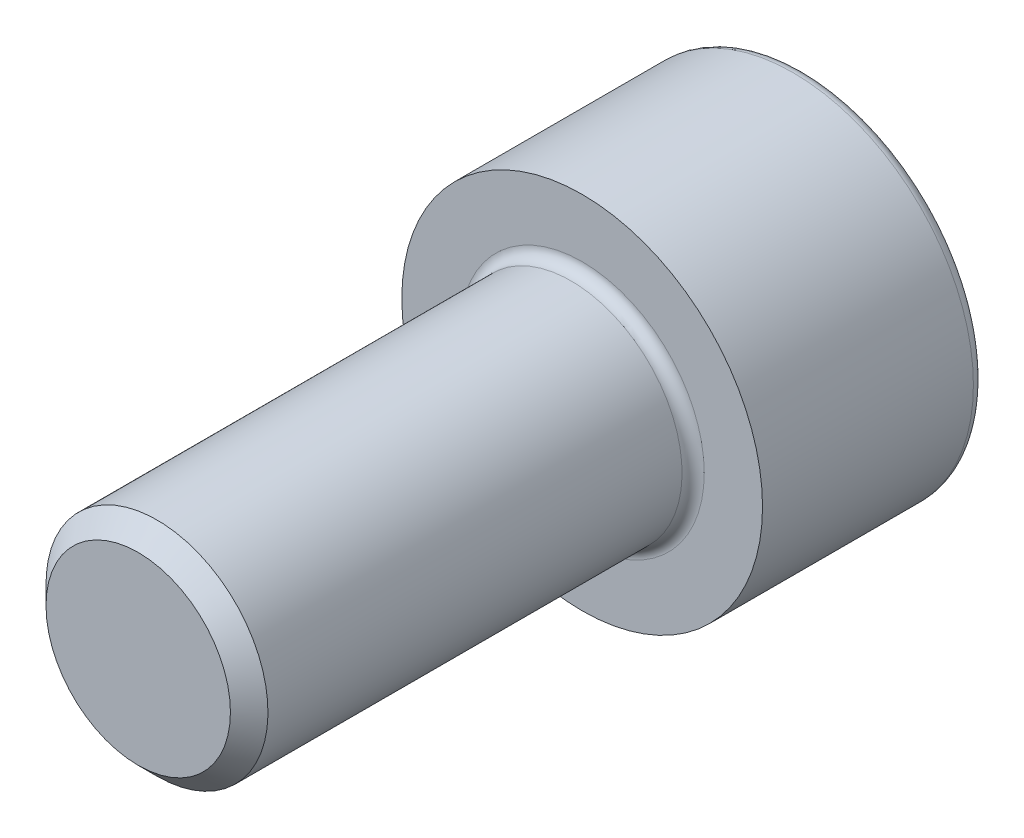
ISO-10303-21;
HEADER;
FILE_DESCRIPTION(('STEP AP214'),'2;1');
FILE_NAME('part.step','',(''),(''),'','','');
FILE_SCHEMA(('AUTOMOTIVE_DESIGN { 1 0 10303 214 1 1 1 1 }'));
ENDSEC;
DATA;
#1=APPLICATION_CONTEXT('core data for automotive mechanical design processes');
#2=APPLICATION_PROTOCOL_DEFINITION('international standard','automotive_design',2000,#1);
#3=PRODUCT_CONTEXT('',#1,'mechanical');
#4=PRODUCT('Part','Part','',(#3));
#5=PRODUCT_RELATED_PRODUCT_CATEGORY('part','',(#4));
#6=PRODUCT_DEFINITION_FORMATION('','',#4);
#7=PRODUCT_DEFINITION_CONTEXT('part definition',#1,'design');
#8=PRODUCT_DEFINITION('design','',#6,#7);
#9=PRODUCT_DEFINITION_SHAPE('','',#8);
#10=(LENGTH_UNIT() NAMED_UNIT(*) SI_UNIT(.MILLI.,.METRE.));
#11=(NAMED_UNIT(*) PLANE_ANGLE_UNIT() SI_UNIT($,.RADIAN.));
#12=(NAMED_UNIT(*) SI_UNIT($,.STERADIAN.) SOLID_ANGLE_UNIT());
#13=UNCERTAINTY_MEASURE_WITH_UNIT(LENGTH_MEASURE(1.E-05),#10,'distance_accuracy_value','');
#14=(GEOMETRIC_REPRESENTATION_CONTEXT(3) GLOBAL_UNCERTAINTY_ASSIGNED_CONTEXT((#13)) GLOBAL_UNIT_ASSIGNED_CONTEXT((#10,
#11,#12)) REPRESENTATION_CONTEXT('',''));
#15=CARTESIAN_POINT('',(0.,0.,0.));
#16=DIRECTION('',(0.,0.,1.));
#17=DIRECTION('',(1.,0.,0.));
#18=AXIS2_PLACEMENT_3D('',#15,#16,#17);
#19=CARTESIAN_POINT('',(0.,0.,-7.99999999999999));
#20=DIRECTION('',(0.,0.,-1.));
#21=DIRECTION('',(0.,1.,0.));
#22=AXIS2_PLACEMENT_3D('',#19,#20,#21);
#23=PLANE('',#22);
#24=CARTESIAN_POINT('',(0.,0.,-7.99999999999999));
#25=DIRECTION('',(0.,0.,-1.));
#26=DIRECTION('',(0.,1.,0.));
#27=AXIS2_PLACEMENT_3D('',#24,#25,#26);
#28=CIRCLE('',#27,6.1);
#29=CARTESIAN_POINT('',(0.,6.1,-7.99999999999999));
#30=VERTEX_POINT('',#29);
#31=EDGE_CURVE('E182',#30,#30,#28,.T.);
#32=ORIENTED_EDGE('',*,*,#31,.T.);
#33=EDGE_LOOP('',(#32));
#34=FACE_BOUND('',#33,.T.);
#35=DIRECTION('',(-1.,0.,0.));
#36=VECTOR('',#35,1.);
#37=CARTESIAN_POINT('',(1.73205080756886,-3.,-7.99999999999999));
#38=LINE('',#37,#36);
#39=CARTESIAN_POINT('',(1.73205080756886,-3.,-7.99999999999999));
#40=VERTEX_POINT('',#39);
#41=CARTESIAN_POINT('',(-1.73205080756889,-3.,-7.99999999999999));
#42=VERTEX_POINT('',#41);
#43=EDGE_CURVE('E133',#40,#42,#38,.T.);
#44=ORIENTED_EDGE('',*,*,#43,.F.);
#45=DIRECTION('',(-0.499999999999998,-0.86602540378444,0.));
#46=VECTOR('',#45,1.);
#47=CARTESIAN_POINT('',(3.46410161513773,0.,-7.99999999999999));
#48=LINE('',#47,#46);
#49=CARTESIAN_POINT('',(3.46410161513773,0.,-7.99999999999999));
#50=VERTEX_POINT('',#49);
#51=EDGE_CURVE('E128',#50,#40,#48,.T.);
#52=ORIENTED_EDGE('',*,*,#51,.F.);
#53=DIRECTION('',(0.499999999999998,-0.86602540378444,0.));
#54=VECTOR('',#53,1.);
#55=CARTESIAN_POINT('',(1.73205080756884,2.99999999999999,-8.));
#56=LINE('',#55,#54);
#57=CARTESIAN_POINT('',(1.73205080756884,2.99999999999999,-8.));
#58=VERTEX_POINT('',#57);
#59=EDGE_CURVE('E126',#58,#50,#56,.T.);
#60=ORIENTED_EDGE('',*,*,#59,.F.);
#61=DIRECTION('',(1.,0.,0.));
#62=VECTOR('',#61,1.);
#63=CARTESIAN_POINT('',(-1.7320508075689,3.,-8.));
#64=LINE('',#63,#62);
#65=CARTESIAN_POINT('',(-1.7320508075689,3.,-8.));
#66=VERTEX_POINT('',#65);
#67=EDGE_CURVE('E112',#66,#58,#64,.T.);
#68=ORIENTED_EDGE('',*,*,#67,.F.);
#69=DIRECTION('',(0.499999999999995,0.866025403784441,0.));
#70=VECTOR('',#69,1.);
#71=CARTESIAN_POINT('',(-3.46410161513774,0.,-7.99999999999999));
#72=LINE('',#71,#70);
#73=CARTESIAN_POINT('',(-3.46410161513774,0.,-7.99999999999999));
#74=VERTEX_POINT('',#73);
#75=EDGE_CURVE('E100',#74,#66,#72,.T.);
#76=ORIENTED_EDGE('',*,*,#75,.F.);
#77=DIRECTION('',(-0.499999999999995,0.866025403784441,0.));
#78=VECTOR('',#77,1.);
#79=CARTESIAN_POINT('',(-1.73205080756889,-3.,-7.99999999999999));
#80=LINE('',#79,#78);
#81=EDGE_CURVE('E136',#42,#74,#80,.T.);
#82=ORIENTED_EDGE('',*,*,#81,.F.);
#83=EDGE_LOOP('',(#44,#52,#60,#68,#76,#82));
#84=FACE_BOUND('',#83,.T.);
#85=ADVANCED_FACE('F30',(#34,#84),#23,.T.);
#86=CARTESIAN_POINT('',(0.,0.,-7.99999999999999));
#87=DIRECTION('',(0.,0.,-1.));
#88=DIRECTION('',(0.,1.,0.));
#89=AXIS2_PLACEMENT_3D('',#86,#87,#88);
#90=CYLINDRICAL_SURFACE('',#89,6.5);
#91=CARTESIAN_POINT('',(0.,0.,-7.6));
#92=DIRECTION('',(0.,0.,-1.));
#93=DIRECTION('',(0.,1.,0.));
#94=AXIS2_PLACEMENT_3D('',#91,#92,#93);
#95=CIRCLE('',#94,6.5);
#96=CARTESIAN_POINT('',(0.,6.5,-7.6));
#97=VERTEX_POINT('',#96);
#98=EDGE_CURVE('E185',#97,#97,#95,.F.);
#99=ORIENTED_EDGE('',*,*,#98,.T.);
#100=EDGE_LOOP('',(#99));
#101=FACE_BOUND('',#100,.T.);
#102=CARTESIAN_POINT('',(0.,0.,0.));
#103=DIRECTION('',(0.,0.,-1.));
#104=DIRECTION('',(0.,1.,0.));
#105=AXIS2_PLACEMENT_3D('',#102,#103,#104);
#106=CIRCLE('',#105,6.5);
#107=CARTESIAN_POINT('',(0.,6.5,0.));
#108=VERTEX_POINT('',#107);
#109=EDGE_CURVE('E172',#108,#108,#106,.T.);
#110=ORIENTED_EDGE('',*,*,#109,.T.);
#111=EDGE_LOOP('',(#110));
#112=FACE_BOUND('',#111,.T.);
#113=ADVANCED_FACE('F205',(#101,#112),#90,.T.);
#114=CARTESIAN_POINT('',(0.,6.49999999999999,0.));
#115=DIRECTION('',(0.,0.,1.));
#116=DIRECTION('',(0.,-1.,0.));
#117=AXIS2_PLACEMENT_3D('',#114,#115,#116);
#118=PLANE('',#117);
#119=CARTESIAN_POINT('',(0.,0.,0.));
#120=DIRECTION('',(0.,0.,1.));
#121=DIRECTION('',(0.,-1.,0.));
#122=AXIS2_PLACEMENT_3D('',#119,#120,#121);
#123=CIRCLE('',#122,4.4);
#124=CARTESIAN_POINT('',(0.,-4.4,0.));
#125=VERTEX_POINT('',#124);
#126=EDGE_CURVE('E176',#125,#125,#123,.F.);
#127=ORIENTED_EDGE('',*,*,#126,.T.);
#128=EDGE_LOOP('',(#127));
#129=FACE_BOUND('',#128,.T.);
#130=ORIENTED_EDGE('',*,*,#109,.F.);
#131=EDGE_LOOP('',(#130));
#132=FACE_BOUND('',#131,.T.);
#133=ADVANCED_FACE('F209',(#129,#132),#118,.T.);
#134=CARTESIAN_POINT('',(0.,0.,-7.99999999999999));
#135=DIRECTION('',(0.,0.,-1.));
#136=DIRECTION('',(0.,1.,0.));
#137=AXIS2_PLACEMENT_3D('',#134,#135,#136);
#138=CYLINDRICAL_SURFACE('',#137,4.);
#139=CARTESIAN_POINT('',(0.,0.,15.3234375));
#140=DIRECTION('',(0.,0.,1.));
#141=DIRECTION('',(0.,-1.,0.));
#142=AXIS2_PLACEMENT_3D('',#139,#140,#141);
#143=CIRCLE('',#142,4.);
#144=CARTESIAN_POINT('',(0.,-4.,15.3234375));
#145=VERTEX_POINT('',#144);
#146=EDGE_CURVE('E37',#145,#145,#143,.F.);
#147=ORIENTED_EDGE('',*,*,#146,.T.);
#148=EDGE_LOOP('',(#147));
#149=FACE_BOUND('',#148,.T.);
#150=CARTESIAN_POINT('',(0.,0.,0.400000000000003));
#151=DIRECTION('',(0.,0.,1.));
#152=DIRECTION('',(0.,-1.,0.));
#153=AXIS2_PLACEMENT_3D('',#150,#151,#152);
#154=CIRCLE('',#153,4.);
#155=CARTESIAN_POINT('',(0.,-4.,0.400000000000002));
#156=VERTEX_POINT('',#155);
#157=EDGE_CURVE('E179',#156,#156,#154,.T.);
#158=ORIENTED_EDGE('',*,*,#157,.T.);
#159=EDGE_LOOP('',(#158));
#160=FACE_BOUND('',#159,.T.);
#161=ADVANCED_FACE('F190',(#149,#160),#138,.T.);
#162=CARTESIAN_POINT('',(0.,4.,16.));
#163=DIRECTION('',(0.,0.,1.));
#164=DIRECTION('',(0.,-1.,0.));
#165=AXIS2_PLACEMENT_3D('',#162,#163,#164);
#166=PLANE('',#165);
#167=CARTESIAN_POINT('',(0.,0.,16.));
#168=DIRECTION('',(0.,0.,1.));
#169=DIRECTION('',(0.,-1.,0.));
#170=AXIS2_PLACEMENT_3D('',#167,#168,#169);
#171=CIRCLE('',#170,3.32343749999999);
#172=CARTESIAN_POINT('',(0.,-3.32343749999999,16.));
#173=VERTEX_POINT('',#172);
#174=EDGE_CURVE('E11',#173,#173,#171,.T.);
#175=ORIENTED_EDGE('',*,*,#174,.T.);
#176=EDGE_LOOP('',(#175));
#177=FACE_BOUND('',#176,.T.);
#178=ADVANCED_FACE('F221',(#177),#166,.T.);
#179=CARTESIAN_POINT('',(-3.46410161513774,0.,-4.));
#180=DIRECTION('',(-0.866025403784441,0.499999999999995,0.));
#181=DIRECTION('',(-0.499999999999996,-0.866025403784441,0.));
#182=AXIS2_PLACEMENT_3D('',#179,#180,#181);
#183=PLANE('',#182);
#184=ORIENTED_EDGE('',*,*,#75,.T.);
#185=DIRECTION('',(0.,0.,-1.));
#186=VECTOR('',#185,1.);
#187=CARTESIAN_POINT('',(-1.7320508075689,3.,-4.));
#188=LINE('',#187,#186);
#189=CARTESIAN_POINT('',(-1.7320508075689,3.,-4.));
#190=VERTEX_POINT('',#189);
#191=EDGE_CURVE('E104',#190,#66,#188,.T.);
#192=ORIENTED_EDGE('',*,*,#191,.F.);
#193=DIRECTION('',(0.499999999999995,0.866025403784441,0.));
#194=VECTOR('',#193,1.);
#195=CARTESIAN_POINT('',(-3.46410161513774,0.,-4.));
#196=LINE('',#195,#194);
#197=CARTESIAN_POINT('',(-2.59807621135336,1.5,-4.));
#198=VERTEX_POINT('',#197);
#199=EDGE_CURVE('E138',#198,#190,#196,.T.);
#200=ORIENTED_EDGE('',*,*,#199,.F.);
#201=CARTESIAN_POINT('',(-3.46410161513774,0.,-4.));
#202=VERTEX_POINT('',#201);
#203=EDGE_CURVE('E139',#202,#198,#196,.T.);
#204=ORIENTED_EDGE('',*,*,#203,.F.);
#205=DIRECTION('',(0.,0.,-1.));
#206=VECTOR('',#205,1.);
#207=CARTESIAN_POINT('',(-3.46410161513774,0.,-4.));
#208=LINE('',#207,#206);
#209=EDGE_CURVE('E108',#202,#74,#208,.T.);
#210=ORIENTED_EDGE('',*,*,#209,.T.);
#211=EDGE_LOOP('',(#184,#192,#200,#204,#210));
#212=FACE_BOUND('',#211,.T.);
#213=ADVANCED_FACE('F102',(#212),#183,.F.);
#214=CARTESIAN_POINT('',(-1.73205080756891,-2.99999999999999,-4.));
#215=DIRECTION('',(-0.866025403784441,-0.499999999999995,0.));
#216=DIRECTION('',(0.499999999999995,-0.866025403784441,0.));
#217=AXIS2_PLACEMENT_3D('',#214,#215,#216);
#218=PLANE('',#217);
#219=ORIENTED_EDGE('',*,*,#81,.T.);
#220=ORIENTED_EDGE('',*,*,#209,.F.);
#221=DIRECTION('',(-0.499999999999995,0.866025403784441,0.));
#222=VECTOR('',#221,1.);
#223=CARTESIAN_POINT('',(-1.73205080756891,-2.99999999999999,-4.));
#224=LINE('',#223,#222);
#225=CARTESIAN_POINT('',(-2.59807621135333,-1.49999999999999,-4.));
#226=VERTEX_POINT('',#225);
#227=EDGE_CURVE('E154',#226,#202,#224,.T.);
#228=ORIENTED_EDGE('',*,*,#227,.F.);
#229=CARTESIAN_POINT('',(-1.73205080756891,-2.99999999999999,-4.));
#230=VERTEX_POINT('',#229);
#231=EDGE_CURVE('E123',#230,#226,#224,.T.);
#232=ORIENTED_EDGE('',*,*,#231,.F.);
#233=DIRECTION('',(0.,0.,-1.));
#234=VECTOR('',#233,1.);
#235=CARTESIAN_POINT('',(-1.73205080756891,-2.99999999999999,-4.));
#236=LINE('',#235,#234);
#237=EDGE_CURVE('E159',#230,#42,#236,.T.);
#238=ORIENTED_EDGE('',*,*,#237,.T.);
#239=EDGE_LOOP('',(#219,#220,#228,#232,#238));
#240=FACE_BOUND('',#239,.T.);
#241=ADVANCED_FACE('F231',(#240),#218,.F.);
#242=CARTESIAN_POINT('',(1.73205080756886,-3.,-4.));
#243=DIRECTION('',(0.,-1.,0.));
#244=DIRECTION('',(0.,0.,-1.));
#245=AXIS2_PLACEMENT_3D('',#242,#243,#244);
#246=PLANE('',#245);
#247=ORIENTED_EDGE('',*,*,#43,.T.);
#248=ORIENTED_EDGE('',*,*,#237,.F.);
#249=DIRECTION('',(-1.,0.,0.));
#250=VECTOR('',#249,1.);
#251=CARTESIAN_POINT('',(1.73205080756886,-3.,-4.));
#252=LINE('',#251,#250);
#253=CARTESIAN_POINT('',(0.,-3.,-4.));
#254=VERTEX_POINT('',#253);
#255=EDGE_CURVE('E150',#254,#230,#252,.T.);
#256=ORIENTED_EDGE('',*,*,#255,.F.);
#257=CARTESIAN_POINT('',(1.73205080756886,-3.,-4.));
#258=VERTEX_POINT('',#257);
#259=EDGE_CURVE('E151',#258,#254,#252,.T.);
#260=ORIENTED_EDGE('',*,*,#259,.F.);
#261=DIRECTION('',(0.,0.,-1.));
#262=VECTOR('',#261,1.);
#263=CARTESIAN_POINT('',(1.73205080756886,-3.,-4.));
#264=LINE('',#263,#262);
#265=EDGE_CURVE('E162',#258,#40,#264,.T.);
#266=ORIENTED_EDGE('',*,*,#265,.T.);
#267=EDGE_LOOP('',(#247,#248,#256,#260,#266));
#268=FACE_BOUND('',#267,.T.);
#269=ADVANCED_FACE('F242',(#268),#246,.F.);
#270=CARTESIAN_POINT('',(3.46410161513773,0.,-4.));
#271=DIRECTION('',(0.86602540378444,-0.499999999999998,0.));
#272=DIRECTION('',(0.499999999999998,0.86602540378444,0.));
#273=AXIS2_PLACEMENT_3D('',#270,#271,#272);
#274=PLANE('',#273);
#275=ORIENTED_EDGE('',*,*,#51,.T.);
#276=ORIENTED_EDGE('',*,*,#265,.F.);
#277=DIRECTION('',(-0.499999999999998,-0.86602540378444,0.));
#278=VECTOR('',#277,1.);
#279=CARTESIAN_POINT('',(3.46410161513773,0.,-4.));
#280=LINE('',#279,#278);
#281=CARTESIAN_POINT('',(2.5980762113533,-1.49999999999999,-4.));
#282=VERTEX_POINT('',#281);
#283=EDGE_CURVE('E146',#282,#258,#280,.T.);
#284=ORIENTED_EDGE('',*,*,#283,.F.);
#285=CARTESIAN_POINT('',(3.46410161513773,0.,-4.));
#286=VERTEX_POINT('',#285);
#287=EDGE_CURVE('E147',#286,#282,#280,.T.);
#288=ORIENTED_EDGE('',*,*,#287,.F.);
#289=DIRECTION('',(0.,0.,-1.));
#290=VECTOR('',#289,1.);
#291=CARTESIAN_POINT('',(3.46410161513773,0.,-4.));
#292=LINE('',#291,#290);
#293=EDGE_CURVE('E165',#286,#50,#292,.T.);
#294=ORIENTED_EDGE('',*,*,#293,.T.);
#295=EDGE_LOOP('',(#275,#276,#284,#288,#294));
#296=FACE_BOUND('',#295,.T.);
#297=ADVANCED_FACE('F238',(#296),#274,.F.);
#298=CARTESIAN_POINT('',(1.73205080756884,2.99999999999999,-4.));
#299=DIRECTION('',(0.86602540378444,0.499999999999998,0.));
#300=DIRECTION('',(-0.499999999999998,0.86602540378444,0.));
#301=AXIS2_PLACEMENT_3D('',#298,#299,#300);
#302=PLANE('',#301);
#303=ORIENTED_EDGE('',*,*,#59,.T.);
#304=ORIENTED_EDGE('',*,*,#293,.F.);
#305=DIRECTION('',(0.499999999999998,-0.86602540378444,0.));
#306=VECTOR('',#305,1.);
#307=CARTESIAN_POINT('',(1.73205080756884,2.99999999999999,-4.));
#308=LINE('',#307,#306);
#309=CARTESIAN_POINT('',(2.59807621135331,1.49999999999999,-4.));
#310=VERTEX_POINT('',#309);
#311=EDGE_CURVE('E144',#310,#286,#308,.T.);
#312=ORIENTED_EDGE('',*,*,#311,.F.);
#313=CARTESIAN_POINT('',(1.73205080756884,2.99999999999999,-4.));
#314=VERTEX_POINT('',#313);
#315=EDGE_CURVE('E44',#314,#310,#308,.T.);
#316=ORIENTED_EDGE('',*,*,#315,.F.);
#317=DIRECTION('',(0.,0.,-1.));
#318=VECTOR('',#317,1.);
#319=CARTESIAN_POINT('',(1.73205080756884,2.99999999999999,-4.));
#320=LINE('',#319,#318);
#321=EDGE_CURVE('E122',#314,#58,#320,.T.);
#322=ORIENTED_EDGE('',*,*,#321,.T.);
#323=EDGE_LOOP('',(#303,#304,#312,#316,#322));
#324=FACE_BOUND('',#323,.T.);
#325=ADVANCED_FACE('F235',(#324),#302,.F.);
#326=CARTESIAN_POINT('',(-1.7320508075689,3.,-4.));
#327=DIRECTION('',(0.,1.,0.));
#328=DIRECTION('',(0.,0.,1.));
#329=AXIS2_PLACEMENT_3D('',#326,#327,#328);
#330=PLANE('',#329);
#331=ORIENTED_EDGE('',*,*,#67,.T.);
#332=ORIENTED_EDGE('',*,*,#321,.F.);
#333=DIRECTION('',(1.,0.,0.));
#334=VECTOR('',#333,1.);
#335=CARTESIAN_POINT('',(-1.7320508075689,3.,-4.));
#336=LINE('',#335,#334);
#337=CARTESIAN_POINT('',(0.,2.99999999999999,-4.));
#338=VERTEX_POINT('',#337);
#339=EDGE_CURVE('E142',#338,#314,#336,.T.);
#340=ORIENTED_EDGE('',*,*,#339,.F.);
#341=EDGE_CURVE('E121',#190,#338,#336,.T.);
#342=ORIENTED_EDGE('',*,*,#341,.F.);
#343=ORIENTED_EDGE('',*,*,#191,.T.);
#344=EDGE_LOOP('',(#331,#332,#340,#342,#343));
#345=FACE_BOUND('',#344,.T.);
#346=ADVANCED_FACE('F116',(#345),#330,.F.);
#347=CARTESIAN_POINT('',(-1.7320508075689,3.,-4.));
#348=DIRECTION('',(0.,0.,-1.));
#349=DIRECTION('',(0.,1.,0.));
#350=AXIS2_PLACEMENT_3D('',#347,#348,#349);
#351=PLANE('',#350);
#352=CARTESIAN_POINT('',(0.,0.,-4.));
#353=DIRECTION('',(0.,0.,-1.));
#354=DIRECTION('',(0.,1.,0.));
#355=AXIS2_PLACEMENT_3D('',#352,#353,#354);
#356=CIRCLE('',#355,3.);
#357=EDGE_CURVE('E158',#198,#338,#356,.T.);
#358=ORIENTED_EDGE('',*,*,#357,.F.);
#359=ORIENTED_EDGE('',*,*,#199,.T.);
#360=ORIENTED_EDGE('',*,*,#341,.T.);
#361=EDGE_LOOP('',(#358,#359,#360));
#362=FACE_BOUND('',#361,.T.);
#363=ADVANCED_FACE('F234',(#362),#351,.T.);
#364=EDGE_CURVE('E334',#226,#198,#356,.T.);
#365=ORIENTED_EDGE('',*,*,#364,.F.);
#366=ORIENTED_EDGE('',*,*,#227,.T.);
#367=ORIENTED_EDGE('',*,*,#203,.T.);
#368=EDGE_LOOP('',(#365,#366,#367));
#369=FACE_BOUND('',#368,.T.);
#370=ADVANCED_FACE('F252',(#369),#351,.T.);
#371=EDGE_CURVE('E339',#254,#226,#356,.T.);
#372=ORIENTED_EDGE('',*,*,#371,.F.);
#373=ORIENTED_EDGE('',*,*,#255,.T.);
#374=ORIENTED_EDGE('',*,*,#231,.T.);
#375=EDGE_LOOP('',(#372,#373,#374));
#376=FACE_BOUND('',#375,.T.);
#377=ADVANCED_FACE('F288',(#376),#351,.T.);
#378=EDGE_CURVE('E345',#282,#254,#356,.T.);
#379=ORIENTED_EDGE('',*,*,#378,.F.);
#380=ORIENTED_EDGE('',*,*,#283,.T.);
#381=ORIENTED_EDGE('',*,*,#259,.T.);
#382=EDGE_LOOP('',(#379,#380,#381));
#383=FACE_BOUND('',#382,.T.);
#384=ADVANCED_FACE('F282',(#383),#351,.T.);
#385=EDGE_CURVE('E173',#310,#282,#356,.T.);
#386=ORIENTED_EDGE('',*,*,#385,.F.);
#387=ORIENTED_EDGE('',*,*,#311,.T.);
#388=ORIENTED_EDGE('',*,*,#287,.T.);
#389=EDGE_LOOP('',(#386,#387,#388));
#390=FACE_BOUND('',#389,.T.);
#391=ADVANCED_FACE('F277',(#390),#351,.T.);
#392=EDGE_CURVE('E169',#338,#310,#356,.T.);
#393=ORIENTED_EDGE('',*,*,#392,.F.);
#394=ORIENTED_EDGE('',*,*,#339,.T.);
#395=ORIENTED_EDGE('',*,*,#315,.T.);
#396=EDGE_LOOP('',(#393,#394,#395));
#397=FACE_BOUND('',#396,.T.);
#398=ADVANCED_FACE('F228',(#397),#351,.T.);
#399=CARTESIAN_POINT('',(0.,0.,-4.));
#400=DIRECTION('',(0.,0.,-1.));
#401=DIRECTION('',(0.,1.,0.));
#402=AXIS2_PLACEMENT_3D('',#399,#400,#401);
#403=CONICAL_SURFACE('',#402,3.,1.0471975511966);
#404=CARTESIAN_POINT('',(0.,0.,-2.26794919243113));
#405=VERTEX_POINT('',#404);
#406=VERTEX_LOOP('',#405);
#407=FACE_BOUND('',#406,.T.);
#408=ORIENTED_EDGE('',*,*,#392,.T.);
#409=ORIENTED_EDGE('',*,*,#385,.T.);
#410=ORIENTED_EDGE('',*,*,#378,.T.);
#411=ORIENTED_EDGE('',*,*,#371,.T.);
#412=ORIENTED_EDGE('',*,*,#364,.T.);
#413=ORIENTED_EDGE('',*,*,#357,.T.);
#414=EDGE_LOOP('',(#408,#409,#410,#411,#412,#413));
#415=FACE_BOUND('',#414,.T.);
#416=ADVANCED_FACE('F225',(#407,#415),#403,.F.);
#417=CARTESIAN_POINT('',(0.,0.,0.400000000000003));
#418=DIRECTION('',(0.,0.,1.));
#419=DIRECTION('',(0.,-1.,0.));
#420=AXIS2_PLACEMENT_3D('',#417,#418,#419);
#421=TOROIDAL_SURFACE('',#420,4.4,0.4);
#422=ORIENTED_EDGE('',*,*,#157,.F.);
#423=EDGE_LOOP('',(#422));
#424=FACE_BOUND('',#423,.T.);
#425=ORIENTED_EDGE('',*,*,#126,.F.);
#426=EDGE_LOOP('',(#425));
#427=FACE_BOUND('',#426,.T.);
#428=ADVANCED_FACE('F200',(#424,#427),#421,.F.);
#429=CARTESIAN_POINT('',(0.,0.,-7.6));
#430=DIRECTION('',(0.,0.,-1.));
#431=DIRECTION('',(0.,1.,0.));
#432=AXIS2_PLACEMENT_3D('',#429,#430,#431);
#433=TOROIDAL_SURFACE('',#432,6.1,0.4);
#434=ORIENTED_EDGE('',*,*,#98,.F.);
#435=EDGE_LOOP('',(#434));
#436=FACE_BOUND('',#435,.T.);
#437=ORIENTED_EDGE('',*,*,#31,.F.);
#438=EDGE_LOOP('',(#437));
#439=FACE_BOUND('',#438,.T.);
#440=ADVANCED_FACE('F195',(#436,#439),#433,.T.);
#441=CARTESIAN_POINT('',(0.,0.,15.3234375));
#442=DIRECTION('',(0.,0.,-1.));
#443=DIRECTION('',(0.,1.,0.));
#444=AXIS2_PLACEMENT_3D('',#441,#442,#443);
#445=CONICAL_SURFACE('',#444,4.,0.785398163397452);
#446=ORIENTED_EDGE('',*,*,#174,.F.);
#447=EDGE_LOOP('',(#446));
#448=FACE_BOUND('',#447,.T.);
#449=ORIENTED_EDGE('',*,*,#146,.F.);
#450=EDGE_LOOP('',(#449));
#451=FACE_BOUND('',#450,.T.);
#452=ADVANCED_FACE('F193',(#448,#451),#445,.T.);
#453=CLOSED_SHELL('',(#85,#113,#133,#161,#178,#213,#241,#269,#297,#325,#346,#363,#370,#377,#384,
#391,#398,#416,#428,#440,#452));
#454=MANIFOLD_SOLID_BREP('B2',#453);
#455=ADVANCED_BREP_SHAPE_REPRESENTATION('',(#18,#454),#14);
#456=SHAPE_DEFINITION_REPRESENTATION(#9,#455);
ENDSEC;
END-ISO-10303-21;
